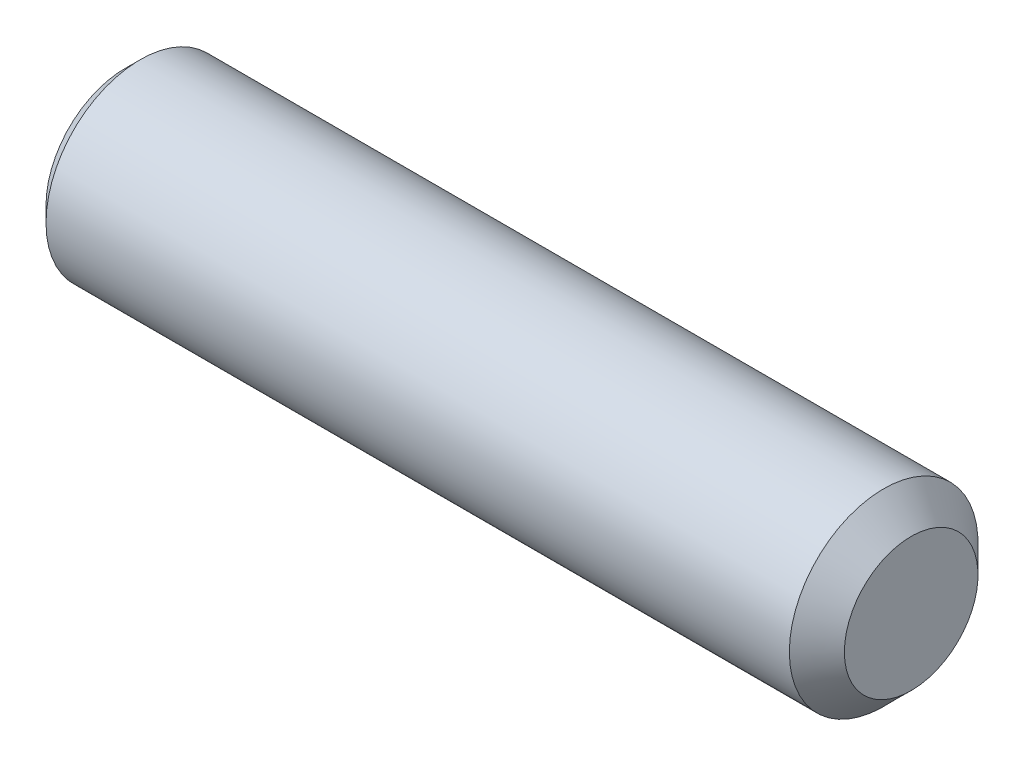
ISO-10303-21;
HEADER;
FILE_DESCRIPTION(('STEP AP214'),'2;1');
FILE_NAME('part.step','',(''),(''),'','','');
FILE_SCHEMA(('AUTOMOTIVE_DESIGN { 1 0 10303 214 1 1 1 1 }'));
ENDSEC;
DATA;
#1=APPLICATION_CONTEXT('core data for automotive mechanical design processes');
#2=APPLICATION_PROTOCOL_DEFINITION('international standard','automotive_design',2000,#1);
#3=PRODUCT_CONTEXT('',#1,'mechanical');
#4=PRODUCT('Part','Part','',(#3));
#5=PRODUCT_RELATED_PRODUCT_CATEGORY('part','',(#4));
#6=PRODUCT_DEFINITION_FORMATION('','',#4);
#7=PRODUCT_DEFINITION_CONTEXT('part definition',#1,'design');
#8=PRODUCT_DEFINITION('design','',#6,#7);
#9=PRODUCT_DEFINITION_SHAPE('','',#8);
#10=(LENGTH_UNIT() NAMED_UNIT(*) SI_UNIT(.MILLI.,.METRE.));
#11=(NAMED_UNIT(*) PLANE_ANGLE_UNIT() SI_UNIT($,.RADIAN.));
#12=(NAMED_UNIT(*) SI_UNIT($,.STERADIAN.) SOLID_ANGLE_UNIT());
#13=UNCERTAINTY_MEASURE_WITH_UNIT(LENGTH_MEASURE(1.E-05),#10,'distance_accuracy_value','');
#14=(GEOMETRIC_REPRESENTATION_CONTEXT(3) GLOBAL_UNCERTAINTY_ASSIGNED_CONTEXT((#13)) GLOBAL_UNIT_ASSIGNED_CONTEXT((#10,
#11,#12)) REPRESENTATION_CONTEXT('',''));
#15=CARTESIAN_POINT('',(0.,0.,0.));
#16=DIRECTION('',(0.,0.,1.));
#17=DIRECTION('',(1.,0.,0.));
#18=AXIS2_PLACEMENT_3D('',#15,#16,#17);
#19=CARTESIAN_POINT('',(0.,0.,0.));
#20=DIRECTION('',(1.,0.,0.));
#21=DIRECTION('',(0.,0.,-1.));
#22=AXIS2_PLACEMENT_3D('',#19,#20,#21);
#23=PLANE('',#22);
#24=CARTESIAN_POINT('',(0.,0.,0.));
#25=DIRECTION('',(-1.,0.,0.));
#26=DIRECTION('',(0.,0.,1.));
#27=AXIS2_PLACEMENT_3D('',#24,#25,#26);
#28=CIRCLE('',#27,5.036);
#29=CARTESIAN_POINT('',(0.,0.,5.036));
#30=VERTEX_POINT('',#29);
#31=EDGE_CURVE('E11',#30,#30,#28,.T.);
#32=ORIENTED_EDGE('',*,*,#31,.T.);
#33=EDGE_LOOP('',(#32));
#34=FACE_BOUND('',#33,.T.);
#35=DIRECTION('',(0.,0.5,0.866025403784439));
#36=VECTOR('',#35,1.);
#37=CARTESIAN_POINT('',(0.,1.73205080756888,-3.));
#38=LINE('',#37,#36);
#39=CARTESIAN_POINT('',(0.,1.73205080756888,-3.));
#40=VERTEX_POINT('',#39);
#41=CARTESIAN_POINT('',(0.,3.46410161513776,0.));
#42=VERTEX_POINT('',#41);
#43=EDGE_CURVE('E53',#40,#42,#38,.T.);
#44=ORIENTED_EDGE('',*,*,#43,.T.);
#45=DIRECTION('',(0.,-0.5,0.866025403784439));
#46=VECTOR('',#45,1.);
#47=CARTESIAN_POINT('',(0.,3.46410161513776,0.));
#48=LINE('',#47,#46);
#49=CARTESIAN_POINT('',(0.,1.73205080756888,3.));
#50=VERTEX_POINT('',#49);
#51=EDGE_CURVE('E124',#42,#50,#48,.T.);
#52=ORIENTED_EDGE('',*,*,#51,.T.);
#53=DIRECTION('',(0.,-1.,0.));
#54=VECTOR('',#53,1.);
#55=CARTESIAN_POINT('',(0.,1.73205080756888,3.));
#56=LINE('',#55,#54);
#57=CARTESIAN_POINT('',(0.,-1.73205080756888,3.));
#58=VERTEX_POINT('',#57);
#59=EDGE_CURVE('E127',#50,#58,#56,.T.);
#60=ORIENTED_EDGE('',*,*,#59,.T.);
#61=DIRECTION('',(0.,-0.5,-0.866025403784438));
#62=VECTOR('',#61,1.);
#63=CARTESIAN_POINT('',(0.,-1.73205080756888,3.));
#64=LINE('',#63,#62);
#65=CARTESIAN_POINT('',(0.,-3.46410161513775,0.));
#66=VERTEX_POINT('',#65);
#67=EDGE_CURVE('E130',#58,#66,#64,.T.);
#68=ORIENTED_EDGE('',*,*,#67,.T.);
#69=DIRECTION('',(0.,0.5,-0.866025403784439));
#70=VECTOR('',#69,1.);
#71=CARTESIAN_POINT('',(0.,-3.46410161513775,0.));
#72=LINE('',#71,#70);
#73=CARTESIAN_POINT('',(0.,-1.73205080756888,-3.));
#74=VERTEX_POINT('',#73);
#75=EDGE_CURVE('E114',#66,#74,#72,.T.);
#76=ORIENTED_EDGE('',*,*,#75,.T.);
#77=DIRECTION('',(0.,1.,0.));
#78=VECTOR('',#77,1.);
#79=CARTESIAN_POINT('',(0.,-1.73205080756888,-3.));
#80=LINE('',#79,#78);
#81=EDGE_CURVE('E133',#74,#40,#80,.T.);
#82=ORIENTED_EDGE('',*,*,#81,.T.);
#83=EDGE_LOOP('',(#44,#52,#60,#68,#76,#82));
#84=FACE_BOUND('',#83,.T.);
#85=ADVANCED_FACE('F39',(#34,#84),#23,.F.);
#86=CARTESIAN_POINT('',(0.964,0.,0.));
#87=DIRECTION('',(1.,0.,0.));
#88=DIRECTION('',(0.,0.,-1.));
#89=AXIS2_PLACEMENT_3D('',#86,#87,#88);
#90=CONICAL_SURFACE('',#89,6.,0.785398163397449);
#91=ORIENTED_EDGE('',*,*,#31,.F.);
#92=EDGE_LOOP('',(#91));
#93=FACE_BOUND('',#92,.T.);
#94=CARTESIAN_POINT('',(0.964,0.,0.));
#95=DIRECTION('',(-1.,0.,0.));
#96=DIRECTION('',(0.,0.,1.));
#97=AXIS2_PLACEMENT_3D('',#94,#95,#96);
#98=CIRCLE('',#97,6.);
#99=CARTESIAN_POINT('',(0.964,0.,6.));
#100=VERTEX_POINT('',#99);
#101=EDGE_CURVE('E46',#100,#100,#98,.T.);
#102=ORIENTED_EDGE('',*,*,#101,.T.);
#103=EDGE_LOOP('',(#102));
#104=FACE_BOUND('',#103,.T.);
#105=ADVANCED_FACE('F152',(#93,#104),#90,.T.);
#106=CARTESIAN_POINT('',(0.,0.,0.));
#107=DIRECTION('',(-1.,0.,0.));
#108=DIRECTION('',(0.,0.,1.));
#109=AXIS2_PLACEMENT_3D('',#106,#107,#108);
#110=CYLINDRICAL_SURFACE('',#109,6.);
#111=ORIENTED_EDGE('',*,*,#101,.F.);
#112=EDGE_LOOP('',(#111));
#113=FACE_BOUND('',#112,.T.);
#114=CARTESIAN_POINT('',(48.25,0.,0.));
#115=DIRECTION('',(-1.,0.,0.));
#116=DIRECTION('',(0.,0.,1.));
#117=AXIS2_PLACEMENT_3D('',#114,#115,#116);
#118=CIRCLE('',#117,6.);
#119=CARTESIAN_POINT('',(48.25,0.,6.));
#120=VERTEX_POINT('',#119);
#121=EDGE_CURVE('E147',#120,#120,#118,.T.);
#122=ORIENTED_EDGE('',*,*,#121,.T.);
#123=EDGE_LOOP('',(#122));
#124=FACE_BOUND('',#123,.T.);
#125=ADVANCED_FACE('F154',(#113,#124),#110,.T.);
#126=CARTESIAN_POINT('',(50.,0.,0.));
#127=DIRECTION('',(-1.,0.,0.));
#128=DIRECTION('',(0.,0.,1.));
#129=AXIS2_PLACEMENT_3D('',#126,#127,#128);
#130=CONICAL_SURFACE('',#129,4.25,0.785398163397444);
#131=ORIENTED_EDGE('',*,*,#121,.F.);
#132=EDGE_LOOP('',(#131));
#133=FACE_BOUND('',#132,.T.);
#134=CARTESIAN_POINT('',(50.,0.,0.));
#135=DIRECTION('',(-1.,0.,0.));
#136=DIRECTION('',(0.,0.,1.));
#137=AXIS2_PLACEMENT_3D('',#134,#135,#136);
#138=CIRCLE('',#137,4.25);
#139=CARTESIAN_POINT('',(50.,0.,4.25));
#140=VERTEX_POINT('',#139);
#141=EDGE_CURVE('E144',#140,#140,#138,.T.);
#142=ORIENTED_EDGE('',*,*,#141,.T.);
#143=EDGE_LOOP('',(#142));
#144=FACE_BOUND('',#143,.T.);
#145=ADVANCED_FACE('F157',(#133,#144),#130,.T.);
#146=CARTESIAN_POINT('',(50.,4.25,0.));
#147=DIRECTION('',(-1.,0.,0.));
#148=DIRECTION('',(0.,0.,1.));
#149=AXIS2_PLACEMENT_3D('',#146,#147,#148);
#150=PLANE('',#149);
#151=ORIENTED_EDGE('',*,*,#141,.F.);
#152=EDGE_LOOP('',(#151));
#153=FACE_BOUND('',#152,.T.);
#154=ADVANCED_FACE('F163',(#153),#150,.F.);
#155=CARTESIAN_POINT('',(8.,1.73205080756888,-3.));
#156=DIRECTION('',(0.,-0.866025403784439,0.5));
#157=DIRECTION('',(0.,-0.5,-0.866025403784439));
#158=AXIS2_PLACEMENT_3D('',#155,#156,#157);
#159=PLANE('',#158);
#160=ORIENTED_EDGE('',*,*,#43,.F.);
#161=DIRECTION('',(-1.,0.,0.));
#162=VECTOR('',#161,1.);
#163=CARTESIAN_POINT('',(8.,1.73205080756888,-3.));
#164=LINE('',#163,#162);
#165=CARTESIAN_POINT('',(8.,1.73205080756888,-3.));
#166=VERTEX_POINT('',#165);
#167=EDGE_CURVE('E119',#166,#40,#164,.T.);
#168=ORIENTED_EDGE('',*,*,#167,.F.);
#169=DIRECTION('',(0.,0.5,0.866025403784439));
#170=VECTOR('',#169,1.);
#171=CARTESIAN_POINT('',(8.,1.73205080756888,-3.));
#172=LINE('',#171,#170);
#173=CARTESIAN_POINT('',(8.,3.46410161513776,0.));
#174=VERTEX_POINT('',#173);
#175=EDGE_CURVE('E136',#166,#174,#172,.T.);
#176=ORIENTED_EDGE('',*,*,#175,.T.);
#177=DIRECTION('',(-1.,0.,0.));
#178=VECTOR('',#177,1.);
#179=CARTESIAN_POINT('',(8.,3.46410161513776,0.));
#180=LINE('',#179,#178);
#181=EDGE_CURVE('E142',#174,#42,#180,.T.);
#182=ORIENTED_EDGE('',*,*,#181,.T.);
#183=EDGE_LOOP('',(#160,#168,#176,#182));
#184=FACE_BOUND('',#183,.T.);
#185=ADVANCED_FACE('F168',(#184),#159,.T.);
#186=CARTESIAN_POINT('',(8.,3.46410161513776,0.));
#187=DIRECTION('',(0.,-0.866025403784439,-0.5));
#188=DIRECTION('',(0.,0.5,-0.866025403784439));
#189=AXIS2_PLACEMENT_3D('',#186,#187,#188);
#190=PLANE('',#189);
#191=ORIENTED_EDGE('',*,*,#51,.F.);
#192=ORIENTED_EDGE('',*,*,#181,.F.);
#193=DIRECTION('',(0.,-0.5,0.866025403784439));
#194=VECTOR('',#193,1.);
#195=CARTESIAN_POINT('',(8.,3.46410161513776,0.));
#196=LINE('',#195,#194);
#197=CARTESIAN_POINT('',(8.,1.73205080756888,3.));
#198=VERTEX_POINT('',#197);
#199=EDGE_CURVE('E92',#174,#198,#196,.T.);
#200=ORIENTED_EDGE('',*,*,#199,.T.);
#201=DIRECTION('',(-1.,0.,0.));
#202=VECTOR('',#201,1.);
#203=CARTESIAN_POINT('',(8.,1.73205080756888,3.));
#204=LINE('',#203,#202);
#205=EDGE_CURVE('E140',#198,#50,#204,.T.);
#206=ORIENTED_EDGE('',*,*,#205,.T.);
#207=EDGE_LOOP('',(#191,#192,#200,#206));
#208=FACE_BOUND('',#207,.T.);
#209=ADVANCED_FACE('F174',(#208),#190,.T.);
#210=CARTESIAN_POINT('',(8.,1.73205080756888,3.));
#211=DIRECTION('',(0.,0.,-1.));
#212=DIRECTION('',(-1.,0.,0.));
#213=AXIS2_PLACEMENT_3D('',#210,#211,#212);
#214=PLANE('',#213);
#215=ORIENTED_EDGE('',*,*,#59,.F.);
#216=ORIENTED_EDGE('',*,*,#205,.F.);
#217=DIRECTION('',(0.,-1.,0.));
#218=VECTOR('',#217,1.);
#219=CARTESIAN_POINT('',(8.,1.73205080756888,3.));
#220=LINE('',#219,#218);
#221=CARTESIAN_POINT('',(8.,-1.73205080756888,3.));
#222=VERTEX_POINT('',#221);
#223=EDGE_CURVE('E110',#198,#222,#220,.T.);
#224=ORIENTED_EDGE('',*,*,#223,.T.);
#225=DIRECTION('',(-1.,0.,0.));
#226=VECTOR('',#225,1.);
#227=CARTESIAN_POINT('',(8.,-1.73205080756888,3.));
#228=LINE('',#227,#226);
#229=EDGE_CURVE('E107',#222,#58,#228,.T.);
#230=ORIENTED_EDGE('',*,*,#229,.T.);
#231=EDGE_LOOP('',(#215,#216,#224,#230));
#232=FACE_BOUND('',#231,.T.);
#233=ADVANCED_FACE('F190',(#232),#214,.T.);
#234=CARTESIAN_POINT('',(8.,-1.73205080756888,3.));
#235=DIRECTION('',(0.,0.866025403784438,-0.5));
#236=DIRECTION('',(0.,0.5,0.866025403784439));
#237=AXIS2_PLACEMENT_3D('',#234,#235,#236);
#238=PLANE('',#237);
#239=ORIENTED_EDGE('',*,*,#67,.F.);
#240=ORIENTED_EDGE('',*,*,#229,.F.);
#241=DIRECTION('',(0.,-0.5,-0.866025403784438));
#242=VECTOR('',#241,1.);
#243=CARTESIAN_POINT('',(8.,-1.73205080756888,3.));
#244=LINE('',#243,#242);
#245=CARTESIAN_POINT('',(8.,-3.46410161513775,0.));
#246=VERTEX_POINT('',#245);
#247=EDGE_CURVE('E102',#222,#246,#244,.T.);
#248=ORIENTED_EDGE('',*,*,#247,.T.);
#249=DIRECTION('',(-1.,0.,0.));
#250=VECTOR('',#249,1.);
#251=CARTESIAN_POINT('',(8.,-3.46410161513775,0.));
#252=LINE('',#251,#250);
#253=EDGE_CURVE('E106',#246,#66,#252,.T.);
#254=ORIENTED_EDGE('',*,*,#253,.T.);
#255=EDGE_LOOP('',(#239,#240,#248,#254));
#256=FACE_BOUND('',#255,.T.);
#257=ADVANCED_FACE('F105',(#256),#238,.T.);
#258=CARTESIAN_POINT('',(8.,-3.46410161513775,0.));
#259=DIRECTION('',(0.,0.866025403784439,0.5));
#260=DIRECTION('',(0.,-0.5,0.866025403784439));
#261=AXIS2_PLACEMENT_3D('',#258,#259,#260);
#262=PLANE('',#261);
#263=ORIENTED_EDGE('',*,*,#75,.F.);
#264=ORIENTED_EDGE('',*,*,#253,.F.);
#265=DIRECTION('',(0.,0.5,-0.866025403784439));
#266=VECTOR('',#265,1.);
#267=CARTESIAN_POINT('',(8.,-3.46410161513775,0.));
#268=LINE('',#267,#266);
#269=CARTESIAN_POINT('',(8.,-1.73205080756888,-3.));
#270=VERTEX_POINT('',#269);
#271=EDGE_CURVE('E109',#246,#270,#268,.T.);
#272=ORIENTED_EDGE('',*,*,#271,.T.);
#273=DIRECTION('',(-1.,0.,0.));
#274=VECTOR('',#273,1.);
#275=CARTESIAN_POINT('',(8.,-1.73205080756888,-3.));
#276=LINE('',#275,#274);
#277=EDGE_CURVE('E83',#270,#74,#276,.T.);
#278=ORIENTED_EDGE('',*,*,#277,.T.);
#279=EDGE_LOOP('',(#263,#264,#272,#278));
#280=FACE_BOUND('',#279,.T.);
#281=ADVANCED_FACE('F112',(#280),#262,.T.);
#282=CARTESIAN_POINT('',(8.,-1.73205080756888,-3.));
#283=DIRECTION('',(0.,0.,1.));
#284=DIRECTION('',(1.,0.,0.));
#285=AXIS2_PLACEMENT_3D('',#282,#283,#284);
#286=PLANE('',#285);
#287=ORIENTED_EDGE('',*,*,#81,.F.);
#288=ORIENTED_EDGE('',*,*,#277,.F.);
#289=DIRECTION('',(0.,1.,0.));
#290=VECTOR('',#289,1.);
#291=CARTESIAN_POINT('',(8.,-1.73205080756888,-3.));
#292=LINE('',#291,#290);
#293=EDGE_CURVE('E61',#270,#166,#292,.T.);
#294=ORIENTED_EDGE('',*,*,#293,.T.);
#295=ORIENTED_EDGE('',*,*,#167,.T.);
#296=EDGE_LOOP('',(#287,#288,#294,#295));
#297=FACE_BOUND('',#296,.T.);
#298=ADVANCED_FACE('F183',(#297),#286,.T.);
#299=CARTESIAN_POINT('',(8.,5.19615242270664,3.));
#300=DIRECTION('',(1.,0.,0.));
#301=DIRECTION('',(0.,0.,-1.));
#302=AXIS2_PLACEMENT_3D('',#299,#300,#301);
#303=PLANE('',#302);
#304=ORIENTED_EDGE('',*,*,#175,.F.);
#305=ORIENTED_EDGE('',*,*,#293,.F.);
#306=ORIENTED_EDGE('',*,*,#271,.F.);
#307=ORIENTED_EDGE('',*,*,#247,.F.);
#308=ORIENTED_EDGE('',*,*,#223,.F.);
#309=ORIENTED_EDGE('',*,*,#199,.F.);
#310=EDGE_LOOP('',(#304,#305,#306,#307,#308,#309));
#311=FACE_BOUND('',#310,.T.);
#312=ADVANCED_FACE('F117',(#311),#303,.F.);
#313=CLOSED_SHELL('',(#85,#105,#125,#145,#154,#185,#209,#233,#257,#281,#298,#312));
#314=MANIFOLD_SOLID_BREP('B2',#313);
#315=ADVANCED_BREP_SHAPE_REPRESENTATION('',(#18,#314),#14);
#316=SHAPE_DEFINITION_REPRESENTATION(#9,#315);
ENDSEC;
END-ISO-10303-21;
